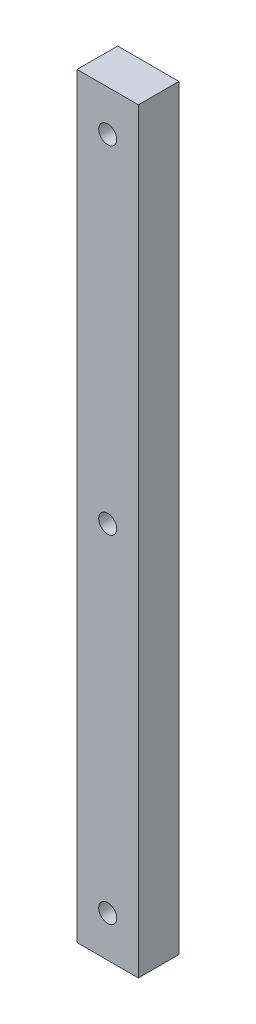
ISO-10303-21;
HEADER;
FILE_DESCRIPTION(('STEP AP214'),'2;1');
FILE_NAME('part.step','',(''),(''),'','','');
FILE_SCHEMA(('AUTOMOTIVE_DESIGN { 1 0 10303 214 1 1 1 1 }'));
ENDSEC;
DATA;
#1=APPLICATION_CONTEXT('core data for automotive mechanical design processes');
#2=APPLICATION_PROTOCOL_DEFINITION('international standard','automotive_design',2000,#1);
#3=PRODUCT_CONTEXT('',#1,'mechanical');
#4=PRODUCT('Part','Part','',(#3));
#5=PRODUCT_RELATED_PRODUCT_CATEGORY('part','',(#4));
#6=PRODUCT_DEFINITION_FORMATION('','',#4);
#7=PRODUCT_DEFINITION_CONTEXT('part definition',#1,'design');
#8=PRODUCT_DEFINITION('design','',#6,#7);
#9=PRODUCT_DEFINITION_SHAPE('','',#8);
#10=(LENGTH_UNIT() NAMED_UNIT(*) SI_UNIT(.MILLI.,.METRE.));
#11=(NAMED_UNIT(*) PLANE_ANGLE_UNIT() SI_UNIT($,.RADIAN.));
#12=(NAMED_UNIT(*) SI_UNIT($,.STERADIAN.) SOLID_ANGLE_UNIT());
#13=UNCERTAINTY_MEASURE_WITH_UNIT(LENGTH_MEASURE(1.E-05),#10,'distance_accuracy_value','');
#14=(GEOMETRIC_REPRESENTATION_CONTEXT(3) GLOBAL_UNCERTAINTY_ASSIGNED_CONTEXT((#13)) GLOBAL_UNIT_ASSIGNED_CONTEXT((#10,
#11,#12)) REPRESENTATION_CONTEXT('',''));
#15=CARTESIAN_POINT('',(0.,0.,0.));
#16=DIRECTION('',(0.,0.,1.));
#17=DIRECTION('',(1.,0.,0.));
#18=AXIS2_PLACEMENT_3D('',#15,#16,#17);
#19=CARTESIAN_POINT('',(-225.425,117.475,12.5984));
#20=DIRECTION('',(1.,0.,0.));
#21=DIRECTION('',(0.,0.,-1.));
#22=AXIS2_PLACEMENT_3D('',#19,#20,#21);
#23=PLANE('',#22);
#24=DIRECTION('',(0.,-1.,0.));
#25=VECTOR('',#24,1.);
#26=CARTESIAN_POINT('',(-225.425,117.475,0.));
#27=LINE('',#26,#25);
#28=CARTESIAN_POINT('',(-225.425,117.475,0.));
#29=VERTEX_POINT('',#28);
#30=CARTESIAN_POINT('',(-225.425,-117.475,0.));
#31=VERTEX_POINT('',#30);
#32=EDGE_CURVE('E95',#29,#31,#27,.T.);
#33=ORIENTED_EDGE('',*,*,#32,.T.);
#34=DIRECTION('',(0.,0.,-1.));
#35=VECTOR('',#34,1.);
#36=CARTESIAN_POINT('',(-225.425,-117.475,12.5984));
#37=LINE('',#36,#35);
#38=CARTESIAN_POINT('',(-225.425,-117.475,12.5984));
#39=VERTEX_POINT('',#38);
#40=EDGE_CURVE('E11',#39,#31,#37,.T.);
#41=ORIENTED_EDGE('',*,*,#40,.F.);
#42=DIRECTION('',(0.,-1.,0.));
#43=VECTOR('',#42,1.);
#44=CARTESIAN_POINT('',(-225.425,117.475,12.5984));
#45=LINE('',#44,#43);
#46=CARTESIAN_POINT('',(-225.425,117.475,12.5984));
#47=VERTEX_POINT('',#46);
#48=EDGE_CURVE('E83',#47,#39,#45,.T.);
#49=ORIENTED_EDGE('',*,*,#48,.F.);
#50=DIRECTION('',(0.,0.,-1.));
#51=VECTOR('',#50,1.);
#52=CARTESIAN_POINT('',(-225.425,117.475,12.5984));
#53=LINE('',#52,#51);
#54=EDGE_CURVE('E91',#47,#29,#53,.T.);
#55=ORIENTED_EDGE('',*,*,#54,.T.);
#56=EDGE_LOOP('',(#33,#41,#49,#55));
#57=FACE_BOUND('',#56,.T.);
#58=ADVANCED_FACE('F32',(#57),#23,.F.);
#59=CARTESIAN_POINT('',(-225.425,-117.475,12.5984));
#60=DIRECTION('',(0.,1.,0.));
#61=DIRECTION('',(0.,0.,1.));
#62=AXIS2_PLACEMENT_3D('',#59,#60,#61);
#63=PLANE('',#62);
#64=DIRECTION('',(1.,0.,0.));
#65=VECTOR('',#64,1.);
#66=CARTESIAN_POINT('',(-225.425,-117.475,0.));
#67=LINE('',#66,#65);
#68=CARTESIAN_POINT('',(-206.375,-117.475,0.));
#69=VERTEX_POINT('',#68);
#70=EDGE_CURVE('E87',#31,#69,#67,.T.);
#71=ORIENTED_EDGE('',*,*,#70,.T.);
#72=DIRECTION('',(0.,0.,-1.));
#73=VECTOR('',#72,1.);
#74=CARTESIAN_POINT('',(-206.375,-117.475,12.5984));
#75=LINE('',#74,#73);
#76=CARTESIAN_POINT('',(-206.375,-117.475,12.5984));
#77=VERTEX_POINT('',#76);
#78=EDGE_CURVE('E40',#77,#69,#75,.T.);
#79=ORIENTED_EDGE('',*,*,#78,.F.);
#80=DIRECTION('',(1.,0.,0.));
#81=VECTOR('',#80,1.);
#82=CARTESIAN_POINT('',(-225.425,-117.475,12.5984));
#83=LINE('',#82,#81);
#84=EDGE_CURVE('E78',#39,#77,#83,.T.);
#85=ORIENTED_EDGE('',*,*,#84,.F.);
#86=ORIENTED_EDGE('',*,*,#40,.T.);
#87=EDGE_LOOP('',(#71,#79,#85,#86));
#88=FACE_BOUND('',#87,.T.);
#89=ADVANCED_FACE('F86',(#88),#63,.F.);
#90=CARTESIAN_POINT('',(-206.375,117.475,12.5984));
#91=DIRECTION('',(-1.,0.,0.));
#92=DIRECTION('',(0.,-1.,0.));
#93=AXIS2_PLACEMENT_3D('',#90,#91,#92);
#94=PLANE('',#93);
#95=DIRECTION('',(0.,1.,0.));
#96=VECTOR('',#95,1.);
#97=CARTESIAN_POINT('',(-206.375,117.475,0.));
#98=LINE('',#97,#96);
#99=CARTESIAN_POINT('',(-206.375,117.475,0.));
#100=VERTEX_POINT('',#99);
#101=EDGE_CURVE('E65',#69,#100,#98,.T.);
#102=ORIENTED_EDGE('',*,*,#101,.T.);
#103=DIRECTION('',(0.,0.,-1.));
#104=VECTOR('',#103,1.);
#105=CARTESIAN_POINT('',(-206.375,117.475,12.5984));
#106=LINE('',#105,#104);
#107=CARTESIAN_POINT('',(-206.375,117.475,12.5984));
#108=VERTEX_POINT('',#107);
#109=EDGE_CURVE('E88',#108,#100,#106,.T.);
#110=ORIENTED_EDGE('',*,*,#109,.F.);
#111=DIRECTION('',(0.,1.,0.));
#112=VECTOR('',#111,1.);
#113=CARTESIAN_POINT('',(-206.375,117.475,12.5984));
#114=LINE('',#113,#112);
#115=EDGE_CURVE('E81',#77,#108,#114,.T.);
#116=ORIENTED_EDGE('',*,*,#115,.F.);
#117=ORIENTED_EDGE('',*,*,#78,.T.);
#118=EDGE_LOOP('',(#102,#110,#116,#117));
#119=FACE_BOUND('',#118,.T.);
#120=ADVANCED_FACE('F89',(#119),#94,.F.);
#121=CARTESIAN_POINT('',(-225.425,117.475,12.5984));
#122=DIRECTION('',(0.,-1.,0.));
#123=DIRECTION('',(0.,0.,-1.));
#124=AXIS2_PLACEMENT_3D('',#121,#122,#123);
#125=PLANE('',#124);
#126=DIRECTION('',(-1.,0.,0.));
#127=VECTOR('',#126,1.);
#128=CARTESIAN_POINT('',(-225.425,117.475,0.));
#129=LINE('',#128,#127);
#130=EDGE_CURVE('E71',#100,#29,#129,.T.);
#131=ORIENTED_EDGE('',*,*,#130,.T.);
#132=ORIENTED_EDGE('',*,*,#54,.F.);
#133=DIRECTION('',(-1.,0.,0.));
#134=VECTOR('',#133,1.);
#135=CARTESIAN_POINT('',(-225.425,117.475,12.5984));
#136=LINE('',#135,#134);
#137=EDGE_CURVE('E48',#108,#47,#136,.T.);
#138=ORIENTED_EDGE('',*,*,#137,.F.);
#139=ORIENTED_EDGE('',*,*,#109,.T.);
#140=EDGE_LOOP('',(#131,#132,#138,#139));
#141=FACE_BOUND('',#140,.T.);
#142=ADVANCED_FACE('F103',(#141),#125,.F.);
#143=CARTESIAN_POINT('',(0.,0.,12.5984));
#144=DIRECTION('',(0.,0.,1.));
#145=DIRECTION('',(1.,0.,0.));
#146=AXIS2_PLACEMENT_3D('',#143,#144,#145);
#147=PLANE('',#146);
#148=CARTESIAN_POINT('',(-215.9,104.775,12.5984));
#149=DIRECTION('',(0.,0.,-1.));
#150=DIRECTION('',(-1.,0.,0.));
#151=AXIS2_PLACEMENT_3D('',#148,#149,#150);
#152=CIRCLE('',#151,2.8067);
#153=CARTESIAN_POINT('',(-218.7067,104.775,12.5984));
#154=VERTEX_POINT('',#153);
#155=EDGE_CURVE('E126',#154,#154,#152,.T.);
#156=ORIENTED_EDGE('',*,*,#155,.T.);
#157=EDGE_LOOP('',(#156));
#158=FACE_BOUND('',#157,.T.);
#159=CARTESIAN_POINT('',(-215.9,-104.775,12.5984));
#160=DIRECTION('',(0.,0.,-1.));
#161=DIRECTION('',(-1.,0.,0.));
#162=AXIS2_PLACEMENT_3D('',#159,#160,#161);
#163=CIRCLE('',#162,2.8067);
#164=CARTESIAN_POINT('',(-218.7067,-104.775,12.5984));
#165=VERTEX_POINT('',#164);
#166=EDGE_CURVE('E120',#165,#165,#163,.T.);
#167=ORIENTED_EDGE('',*,*,#166,.T.);
#168=EDGE_LOOP('',(#167));
#169=FACE_BOUND('',#168,.T.);
#170=CARTESIAN_POINT('',(-215.9,0.,12.5984));
#171=DIRECTION('',(0.,0.,-1.));
#172=DIRECTION('',(-1.,0.,0.));
#173=AXIS2_PLACEMENT_3D('',#170,#171,#172);
#174=CIRCLE('',#173,2.8067);
#175=CARTESIAN_POINT('',(-218.7067,0.,12.5984));
#176=VERTEX_POINT('',#175);
#177=EDGE_CURVE('E98',#176,#176,#174,.T.);
#178=ORIENTED_EDGE('',*,*,#177,.T.);
#179=EDGE_LOOP('',(#178));
#180=FACE_BOUND('',#179,.T.);
#181=ORIENTED_EDGE('',*,*,#48,.T.);
#182=ORIENTED_EDGE('',*,*,#84,.T.);
#183=ORIENTED_EDGE('',*,*,#115,.T.);
#184=ORIENTED_EDGE('',*,*,#137,.T.);
#185=EDGE_LOOP('',(#181,#182,#183,#184));
#186=FACE_BOUND('',#185,.T.);
#187=ADVANCED_FACE('F79',(#158,#169,#180,#186),#147,.T.);
#188=CARTESIAN_POINT('',(0.,0.,0.));
#189=DIRECTION('',(0.,0.,1.));
#190=DIRECTION('',(1.,0.,0.));
#191=AXIS2_PLACEMENT_3D('',#188,#189,#190);
#192=PLANE('',#191);
#193=CARTESIAN_POINT('',(-215.9,104.775,0.));
#194=DIRECTION('',(0.,0.,-1.));
#195=DIRECTION('',(-1.,0.,0.));
#196=AXIS2_PLACEMENT_3D('',#193,#194,#195);
#197=CIRCLE('',#196,2.8067);
#198=CARTESIAN_POINT('',(-218.7067,104.775,0.));
#199=VERTEX_POINT('',#198);
#200=EDGE_CURVE('E129',#199,#199,#197,.T.);
#201=ORIENTED_EDGE('',*,*,#200,.F.);
#202=EDGE_LOOP('',(#201));
#203=FACE_BOUND('',#202,.T.);
#204=CARTESIAN_POINT('',(-215.9,-104.775,0.));
#205=DIRECTION('',(0.,0.,-1.));
#206=DIRECTION('',(-1.,0.,0.));
#207=AXIS2_PLACEMENT_3D('',#204,#205,#206);
#208=CIRCLE('',#207,2.8067);
#209=CARTESIAN_POINT('',(-218.7067,-104.775,0.));
#210=VERTEX_POINT('',#209);
#211=EDGE_CURVE('E123',#210,#210,#208,.T.);
#212=ORIENTED_EDGE('',*,*,#211,.F.);
#213=EDGE_LOOP('',(#212));
#214=FACE_BOUND('',#213,.T.);
#215=CARTESIAN_POINT('',(-215.9,0.,0.));
#216=DIRECTION('',(0.,0.,-1.));
#217=DIRECTION('',(-1.,0.,0.));
#218=AXIS2_PLACEMENT_3D('',#215,#216,#217);
#219=CIRCLE('',#218,5.55624999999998);
#220=CARTESIAN_POINT('',(-221.45625,0.,0.));
#221=VERTEX_POINT('',#220);
#222=EDGE_CURVE('E117',#221,#221,#219,.T.);
#223=ORIENTED_EDGE('',*,*,#222,.F.);
#224=EDGE_LOOP('',(#223));
#225=FACE_BOUND('',#224,.T.);
#226=ORIENTED_EDGE('',*,*,#32,.F.);
#227=ORIENTED_EDGE('',*,*,#130,.F.);
#228=ORIENTED_EDGE('',*,*,#101,.F.);
#229=ORIENTED_EDGE('',*,*,#70,.F.);
#230=EDGE_LOOP('',(#226,#227,#228,#229));
#231=FACE_BOUND('',#230,.T.);
#232=ADVANCED_FACE('F106',(#203,#214,#225,#231),#192,.F.);
#233=CARTESIAN_POINT('',(-215.9,0.,0.));
#234=DIRECTION('',(0.,0.,-1.));
#235=DIRECTION('',(-1.,0.,0.));
#236=AXIS2_PLACEMENT_3D('',#233,#234,#235);
#237=CYLINDRICAL_SURFACE('',#236,2.8067);
#238=ORIENTED_EDGE('',*,*,#177,.F.);
#239=EDGE_LOOP('',(#238));
#240=FACE_BOUND('',#239,.T.);
#241=CARTESIAN_POINT('',(-215.9,0.,3.1242));
#242=DIRECTION('',(0.,0.,-1.));
#243=DIRECTION('',(-1.,0.,0.));
#244=AXIS2_PLACEMENT_3D('',#241,#242,#243);
#245=CIRCLE('',#244,2.8067);
#246=CARTESIAN_POINT('',(-218.7067,0.,3.1242));
#247=VERTEX_POINT('',#246);
#248=EDGE_CURVE('E111',#247,#247,#245,.T.);
#249=ORIENTED_EDGE('',*,*,#248,.T.);
#250=EDGE_LOOP('',(#249));
#251=FACE_BOUND('',#250,.T.);
#252=ADVANCED_FACE('F137',(#240,#251),#237,.F.);
#253=CARTESIAN_POINT('',(-213.0933,0.,3.1242));
#254=DIRECTION('',(0.,0.,1.));
#255=DIRECTION('',(1.,0.,0.));
#256=AXIS2_PLACEMENT_3D('',#253,#254,#255);
#257=PLANE('',#256);
#258=ORIENTED_EDGE('',*,*,#248,.F.);
#259=EDGE_LOOP('',(#258));
#260=FACE_BOUND('',#259,.T.);
#261=CARTESIAN_POINT('',(-215.9,0.,3.1242));
#262=DIRECTION('',(0.,0.,-1.));
#263=DIRECTION('',(-1.,0.,0.));
#264=AXIS2_PLACEMENT_3D('',#261,#262,#263);
#265=CIRCLE('',#264,5.55624999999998);
#266=CARTESIAN_POINT('',(-221.45625,0.,3.1242));
#267=VERTEX_POINT('',#266);
#268=EDGE_CURVE('E114',#267,#267,#265,.T.);
#269=ORIENTED_EDGE('',*,*,#268,.T.);
#270=EDGE_LOOP('',(#269));
#271=FACE_BOUND('',#270,.T.);
#272=ADVANCED_FACE('F146',(#260,#271),#257,.F.);
#273=CARTESIAN_POINT('',(-215.9,0.,0.));
#274=DIRECTION('',(0.,0.,-1.));
#275=DIRECTION('',(-1.,0.,0.));
#276=AXIS2_PLACEMENT_3D('',#273,#274,#275);
#277=CYLINDRICAL_SURFACE('',#276,5.55624999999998);
#278=ORIENTED_EDGE('',*,*,#268,.F.);
#279=EDGE_LOOP('',(#278));
#280=FACE_BOUND('',#279,.T.);
#281=ORIENTED_EDGE('',*,*,#222,.T.);
#282=EDGE_LOOP('',(#281));
#283=FACE_BOUND('',#282,.T.);
#284=ADVANCED_FACE('F143',(#280,#283),#277,.F.);
#285=CARTESIAN_POINT('',(-215.9,-104.775,0.));
#286=DIRECTION('',(0.,0.,-1.));
#287=DIRECTION('',(-1.,0.,0.));
#288=AXIS2_PLACEMENT_3D('',#285,#286,#287);
#289=CYLINDRICAL_SURFACE('',#288,2.8067);
#290=ORIENTED_EDGE('',*,*,#166,.F.);
#291=EDGE_LOOP('',(#290));
#292=FACE_BOUND('',#291,.T.);
#293=ORIENTED_EDGE('',*,*,#211,.T.);
#294=EDGE_LOOP('',(#293));
#295=FACE_BOUND('',#294,.T.);
#296=ADVANCED_FACE('F145',(#292,#295),#289,.F.);
#297=CARTESIAN_POINT('',(-215.9,104.775,0.));
#298=DIRECTION('',(0.,0.,-1.));
#299=DIRECTION('',(-1.,0.,0.));
#300=AXIS2_PLACEMENT_3D('',#297,#298,#299);
#301=CYLINDRICAL_SURFACE('',#300,2.8067);
#302=ORIENTED_EDGE('',*,*,#155,.F.);
#303=EDGE_LOOP('',(#302));
#304=FACE_BOUND('',#303,.T.);
#305=ORIENTED_EDGE('',*,*,#200,.T.);
#306=EDGE_LOOP('',(#305));
#307=FACE_BOUND('',#306,.T.);
#308=ADVANCED_FACE('F133',(#304,#307),#301,.F.);
#309=CLOSED_SHELL('',(#58,#89,#120,#142,#187,#232,#252,#272,#284,#296,#308));
#310=MANIFOLD_SOLID_BREP('B2',#309);
#311=ADVANCED_BREP_SHAPE_REPRESENTATION('',(#18,#310),#14);
#312=SHAPE_DEFINITION_REPRESENTATION(#9,#311);
ENDSEC;
END-ISO-10303-21;
